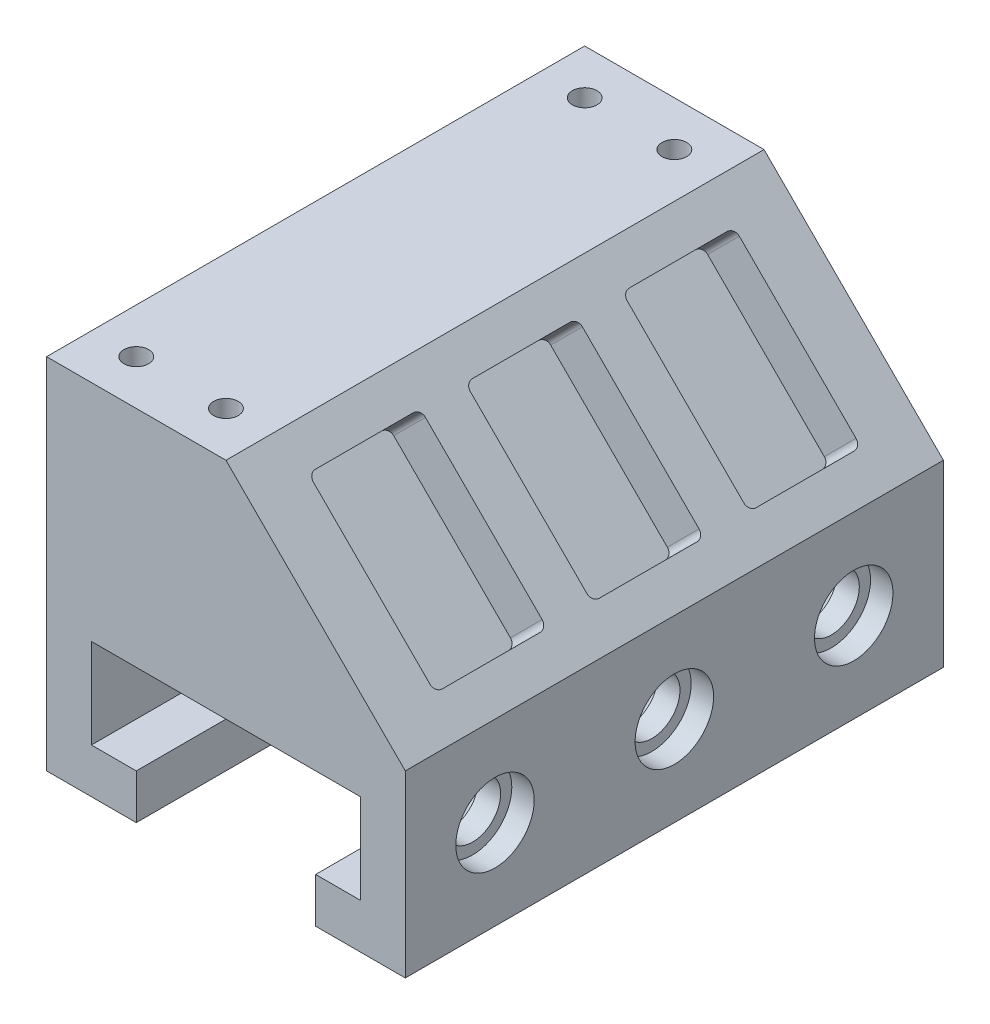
from build123d import *

# Parameters (mm, degrees)
EXTRUDE1_DEPTH     = 152.4
CUT_EXTRUDE1_DEPTH = 12.7
LPATTERN1_COUNT    = 3
LPATTERN1_PITCH    = 50.8
SKETCH5_R          = 3.4925
CUT_EXTRUDE3_DEPTH = 25.4


with BuildPart() as part:
    # Sketch1 (on Front Plane) → Extrude1 (new body)
    with BuildSketch(Plane.XY):
        Polygon((0, 0), (0, 101.6), (50.8, 101.6), (101.6, 50.8), (101.6, 0), (76.2, 0), (76.2, 12.7), (88.9, 12.7), (88.9, 38.1), (12.7, 38.1), (12.7, 12.7), (25.4, 12.7), (25.4, 0), align=None)
    extrude(amount=-EXTRUDE1_DEPTH)

    # Sketch2 → Cut-Extrude1 (cut)
    with BuildSketch(Plane(origin=(76.2, 76.2, 0), x_dir=(-0.7071067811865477, 0.7071067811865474, 0), z_dir=(0.7071067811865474, 0.7071067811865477, 0))):
        with BuildLine():
            Line((-23.368, -15.875), (23.368, -15.875))
            ThreePointArc((23.368, -15.875), (24.804840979, -16.470159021), (25.4, -17.907))
            Line((25.4, -17.907), (25.4, -45.593))
            ThreePointArc((25.4, -45.593), (24.804840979, -47.029840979), (23.368, -47.625))
            Line((23.368, -47.625), (-23.368, -47.625))
            ThreePointArc((-23.368, -47.625), (-24.804840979, -47.029840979), (-25.4, -45.593))
            Line((-25.4, -45.593), (-25.4, -17.907))
            ThreePointArc((-25.4, -17.907), (-24.804840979, -16.470159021), (-23.368, -15.875))
        make_face()
        with BuildLine():
            Line((-23.368, -60.325), (23.368, -60.325))
            ThreePointArc((23.368, -60.325), (24.804840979, -60.920159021), (25.4, -62.357))
            Line((25.4, -62.357), (25.4, -90.043))
            ThreePointArc((25.4, -90.043), (24.804840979, -91.479840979), (23.368, -92.075))
            Line((23.368, -92.075), (-23.368, -92.075))
            ThreePointArc((-23.368, -92.075), (-24.804840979, -91.479840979), (-25.4, -90.043))
            Line((-25.4, -90.043), (-25.4, -62.357))
            ThreePointArc((-25.4, -62.357), (-24.804840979, -60.920159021), (-23.368, -60.325))
        make_face()
        with BuildLine():
            Line((-23.368, -104.775), (23.368, -104.775))
            ThreePointArc((23.368, -104.775), (24.804840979, -105.370159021), (25.4, -106.807))
            Line((25.4, -106.807), (25.4, -134.493))
            ThreePointArc((25.4, -134.493), (24.804840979, -135.929840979), (23.368, -136.525))
            Line((23.368, -136.525), (-23.368, -136.525))
            ThreePointArc((-23.368, -136.525), (-24.804840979, -135.929840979), (-25.4, -134.493))
            Line((-25.4, -134.493), (-25.4, -106.807))
            ThreePointArc((-25.4, -106.807), (-24.804840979, -105.370159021), (-23.368, -104.775))
        make_face()
    extrude(amount=-CUT_EXTRUDE1_DEPTH, mode=Mode.SUBTRACT)

    # Sketch3 → CBORE for 1_4 Binding Head Machine Screw (revolve, cut)
    with BuildSketch(Plane(origin=(101.6, 25.4, -25.4), x_dir=(0, 0, -1), z_dir=(0, 1, 0))):
        Polygon((0, 0), (0, 20.644331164), (7.9375, 15.875), (7.9375, 6.35), (11.1125, 6.35), (11.1125, 0), align=None)
    cbore_for_1_4_binding_head_machine_screw = revolve(axis=Axis((107.95, 25.4, -25.4), (-1, 0, 0)), mode=Mode.SUBTRACT)

    # LPattern1: CBORE for 1_4 Binding Head Machine Screw ×3
    with Locations(*[(0, 0, -i * LPATTERN1_PITCH) for i in range(1, LPATTERN1_COUNT)]):
        add(cbore_for_1_4_binding_head_machine_screw, mode=Mode.SUBTRACT)

    # Mirror1: CBORE for 1_4 Binding Head Machine Screw across plane
    add(cbore_for_1_4_binding_head_machine_screw.mirror(Plane(origin=(50.8, 0, 0), x_dir=(0, 0, 1), z_dir=(1, 0, 0))), mode=Mode.SUBTRACT)

    # Mirror1 copy 1 sketch → Mirror1 copy 1 (revolve, cut)
    with BuildSketch(Plane(origin=(0, 25.4, -76.2), x_dir=(0, 0, -1), z_dir=(0, 1, 0))):
        Polygon((0, 0), (0, -20.644331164), (7.9375, -15.875), (7.9375, -6.35), (11.1125, -6.35), (11.1125, 0), align=None)
    revolve(axis=Axis((-6.35, 25.4, -76.2), (-1, 0, 0)), mode=Mode.SUBTRACT)

    # Mirror1 copy 2 sketch → Mirror1 copy 2 (revolve, cut)
    with BuildSketch(Plane(origin=(0, 25.4, -127), x_dir=(0, 0, -1), z_dir=(0, 1, 0))):
        Polygon((0, 0), (0, -20.644331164), (7.9375, -15.875), (7.9375, -6.35), (11.1125, -6.35), (11.1125, 0), align=None)
    revolve(axis=Axis((-6.35, 25.4, -127), (-1, 0, 0)), mode=Mode.SUBTRACT)

    # Sketch5 → Cut-Extrude3 (cut)
    with BuildSketch(Plane(origin=(0, 101.6, 0), x_dir=(-1, 0, 0), z_dir=(0, 1, 0))):
        with Locations(Location((-12.7, -139.7, 0), (0, 0, 90))):
            Circle(SKETCH5_R)
        with Locations(Location((-38.1, -139.7, 0), (0, 0, 90))):
            Circle(SKETCH5_R)
        with Locations(Location((-38.1, -12.7, 0), (0, 0, 90))):
            Circle(SKETCH5_R)
        with Locations(Location((-12.7, -12.7, 0), (0, 0, 90))):
            Circle(SKETCH5_R)
    extrude(amount=-CUT_EXTRUDE3_DEPTH, mode=Mode.SUBTRACT)


solid = part.part
